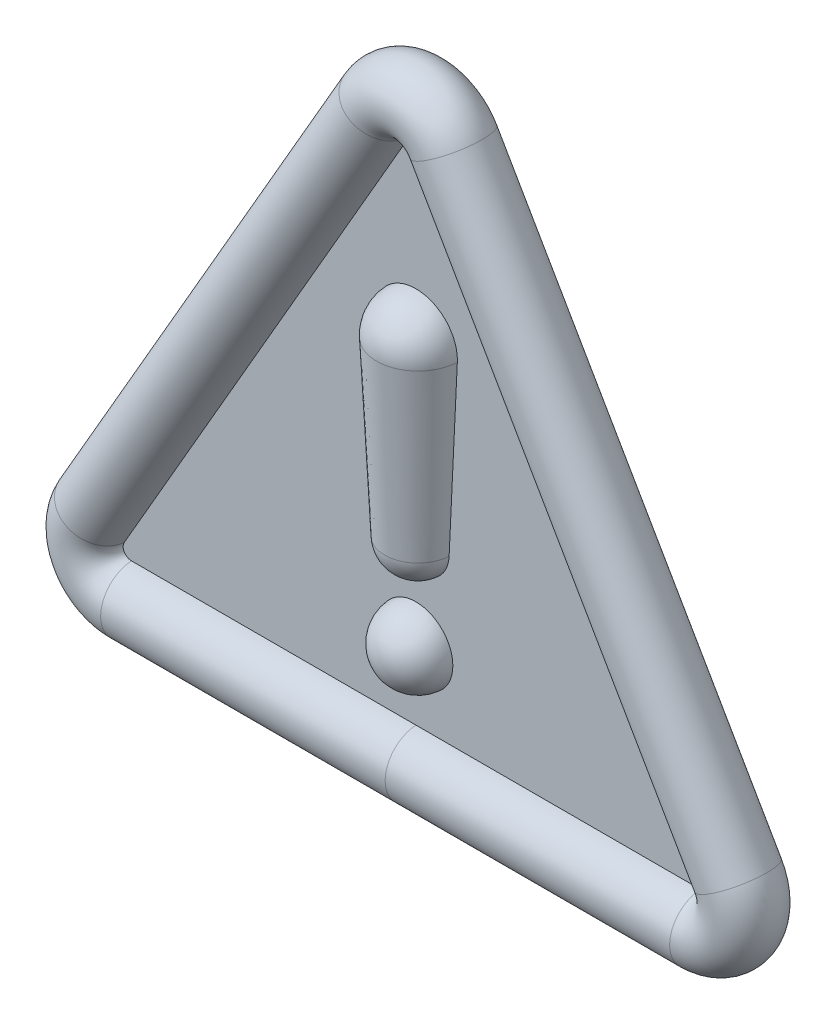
from build123d import *

# Parameters (mm, degrees)
SKIZZE2_R                            = 8
AUFSATZ_LINEAR_AUSTRAGEN2_DEPTH      = 0.5
AUFSATZ_LINEAR_AUSTRAGEN2_DEPTH_BACK = 0.5


with BuildPart() as part:
    # Austragung1: sweep along a path in Skizze1
    with BuildLine(Plane.XY) as austragung1_path:
        Line((-8.660254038, 85), (-77.942286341, -35))
        ThreePointArc((-77.942286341, -35), (-77.942286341, -45), (-69.282032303, -50))
        Line((-69.282032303, -50), (69.282032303, -50))
        ThreePointArc((69.282032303, -50), (77.942286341, -45), (77.942286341, -35))
        Line((77.942286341, -35), (8.660254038, 85))
        ThreePointArc((8.660254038, 85), (0, 90), (-8.660254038, 85))
    # Skizze2 → Austragung1 (sweep)
    with BuildSketch(Plane(origin=(0, 0, 0), x_dir=(0, 0, -1), z_dir=(1, 0, 0))):
        with Locations((0, -50)):
            Circle(SKIZZE2_R)
    sweep(path=austragung1_path.line)



with BuildPart() as body_2:
    # Skizze20 → Rotation1 (revolve)
    with BuildSketch(Plane.XY, mode=Mode.PRIVATE) as rotation1_sk:
        with BuildLine():
            Line((0, 0), (0, -10))
            Line((0, -10), (0.1, -10))
            ThreePointArc((0.1, -10), (5.620524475, -7.789974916), (8.090924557, -2.380952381))
            Line((8.090924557, -2.380952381), (10.088655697, 39.523809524))
            ThreePointArc((10.088655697, 39.523809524), (7.337468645, 46.900655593), (0.1, 50))
            Line((0.1, 50), (0, 50))
            Line((0, 50), (0, 0))
        make_face()
    revolve(rotation1_sk.sketch.rotate(Axis((0, 0, 0), (0, 1, 0)), 90), axis=Axis((0, 0, 0), (0, 1, 0)))


with BuildPart() as body_3:
    # Skizze24 → Rotation2 (revolve)
    with BuildSketch(Plane.XY):
        with BuildLine():
            Line((0, -34), (0, -16))
            ThreePointArc((0, -16), (9, -25), (0, -34))
        make_face()
    revolve(axis=Axis((0, -34, 0), (0, 1, 0)))


with BuildPart() as part_1:
    add(part.part)

    add(body_2.part)  # Aufsatz-Linear austragen2 merges body 2

    add(body_3.part)  # Aufsatz-Linear austragen2 merges body 3
    # Skizze25 → Aufsatz-Linear austragen2 (add, two sides: drawn at the far end of the back side and taken through both)
    with BuildSketch(Plane.XY.offset(-AUFSATZ_LINEAR_AUSTRAGEN2_DEPTH_BACK)):
        Polygon((-77.942286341, -35), (-69.282032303, -50), (69.282032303, -50), (77.942286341, -35), (8.660254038, 85), (-8.660254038, 85), align=None)
    extrude(amount=AUFSATZ_LINEAR_AUSTRAGEN2_DEPTH + AUFSATZ_LINEAR_AUSTRAGEN2_DEPTH_BACK)


solid = part_1.part
